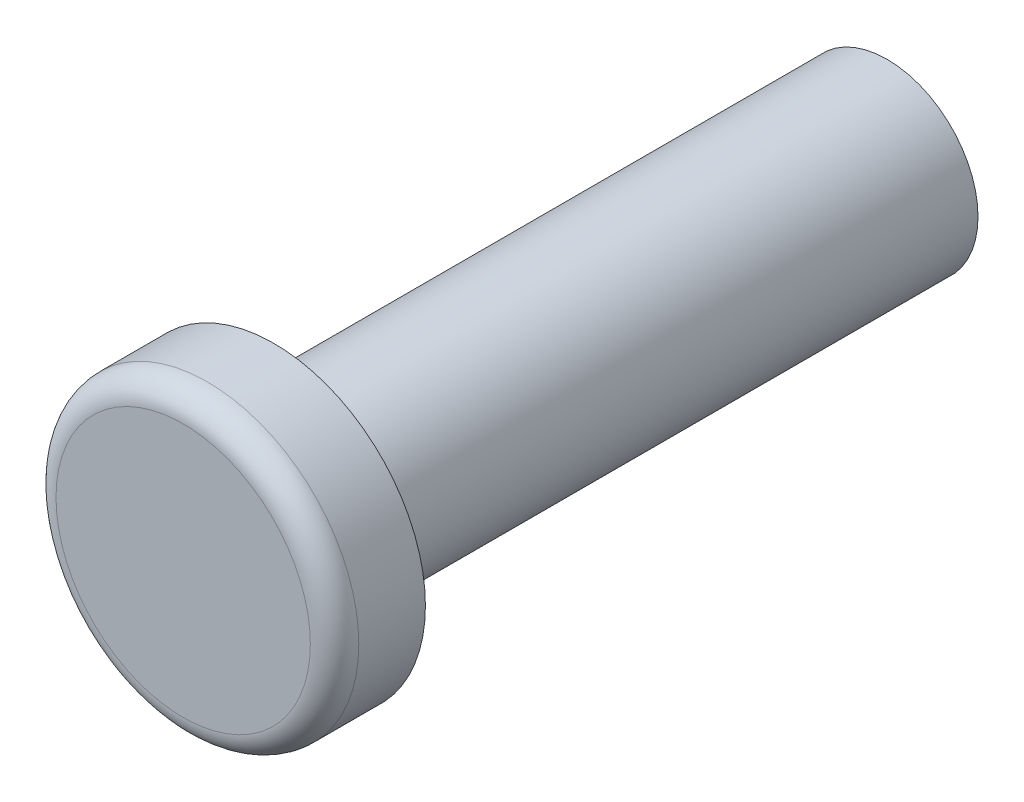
from build123d import *

# Parameters (mm, degrees)
SKETCH_3_R      = 5
EXTRUDE_1_DEPTH = 3
SKETCH_4_R      = 3
EXTRUDE_2_DEPTH = 20.25
FILLET_1_R      = 0.8


with BuildPart() as part:
    # Sketch 3 → Extrude 1 (new body)
    with BuildSketch(Plane.XY):
        Circle(SKETCH_3_R)
    extrude(amount=EXTRUDE_1_DEPTH)

    # Sketch 4 → Extrude 2 (add)
    with BuildSketch(Plane(origin=(0, 0, 0), x_dir=(-1, 0, 0), z_dir=(0, 0, -1))):
        with Locations(Location((0, 0, 0), (0, 0, 180))):
            Circle(SKETCH_4_R)
    extrude(amount=EXTRUDE_2_DEPTH)

    # Fillet 1
    fillet_1_edges = [part.edges().sort_by_distance(p)[0] for p in [
        (-5, 0, 3),
    ]]
    fillet(fillet_1_edges, radius=FILLET_1_R)


solid = part.part
